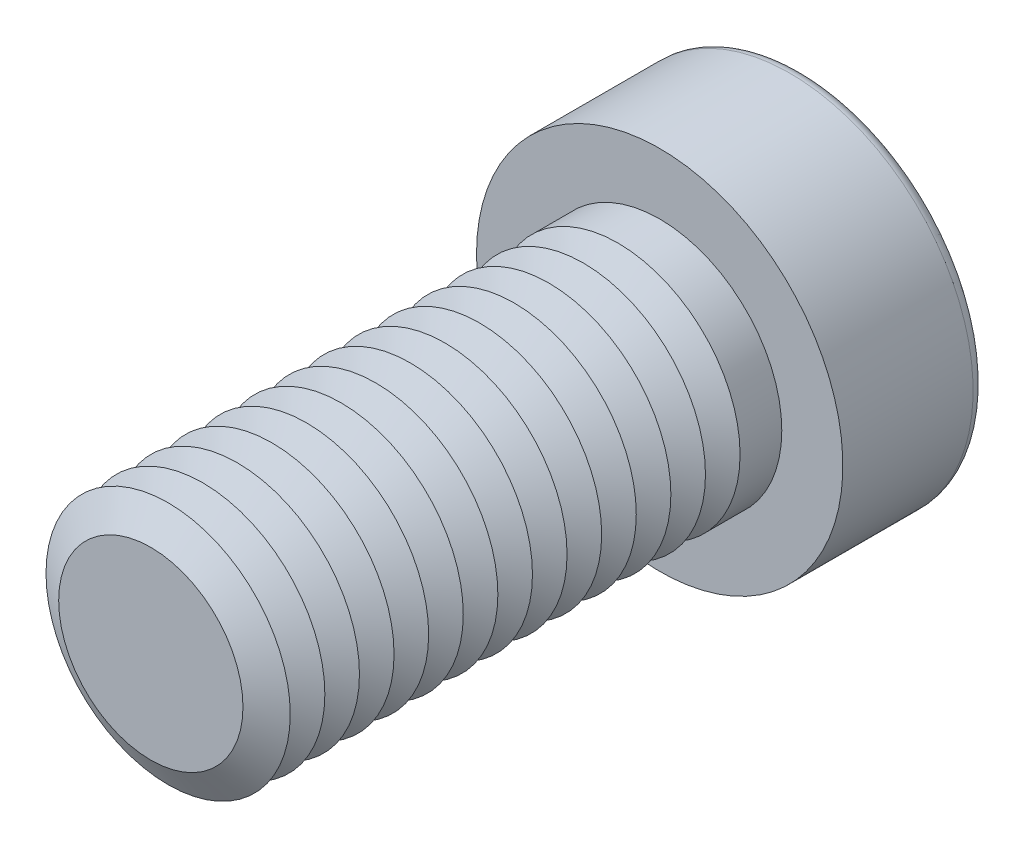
from build123d import *

# Parameters (mm, degrees)
SKETCH1_R           = 6
BOSS_EXTRUDE1_DEPTH = 25
SKETCH2_R           = 9
BOSS_EXTRUDE2_DEPTH = 7
CUT_EXTRUDE1_DEPTH  = 6
FILLET1_R           = 0.6
LPATTERN1_COUNT     = 14
LPATTERN1_PITCH     = 1.7


with BuildPart() as part:
    # Sketch1 → Boss-Extrude1 (new body)
    with BuildSketch(Plane.XY):
        Circle(SKETCH1_R)
    extrude(amount=BOSS_EXTRUDE1_DEPTH)

    # Sketch2 → Boss-Extrude2 (add)
    with BuildSketch(Plane(origin=(0, 0, 0), x_dir=(-1, 0, 0), z_dir=(0, 0, -1))):
        Circle(SKETCH2_R)
    extrude(amount=BOSS_EXTRUDE2_DEPTH)

    # Sketch3 → Cut-Extrude1 (cut)
    with BuildSketch(Plane(origin=(0, 0, -7), x_dir=(-1, 0, 0), z_dir=(0, 0, -1))):
        Polygon((-2.309401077, 4), (-4.618802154, 0), (-2.309401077, -4), (2.309401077, -4), (4.618802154, 0), (2.309401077, 4), align=None)
    extrude(amount=-CUT_EXTRUDE1_DEPTH, mode=Mode.SUBTRACT)

    # Fillet1
    fillet1_edges = [part.edges().sort_by_distance(p)[0] for p in [
        (9, 0, -7),
    ]]
    fillet(fillet1_edges, radius=FILLET1_R)

    # Cut-Extrude2 cone 1 section (on through the dimple's axis) → Cut-Extrude2 (revolve, cut)
    with BuildSketch(Plane(origin=(0, 0, -1), x_dir=(0, 1, 0), z_dir=(1, 0, 0))):
        Polygon((0, 0), (4, 0), (0, 2.309401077), align=None)
    revolve(axis=Axis((0, 0, -1), (0, 0, 1)), mode=Mode.SUBTRACT)

    # Cut-Extrude3 cone 1 section (on through the dimple's axis) → Cut-Extrude3 (revolve, cut)
    with BuildSketch(Plane(origin=(0, 0, -7), x_dir=(0, 1, 0), z_dir=(1, 0, 0))):
        Polygon((0, 0), (4.618802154, 0), (0, 1.237604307), align=None)
    revolve(axis=Axis((0, 0, -7), (0, 0, 1)), mode=Mode.SUBTRACT)

    # Sketch7 → Cut-Revolve1 (revolve, cut)
    with BuildSketch(Plane(origin=(0, 0, 0), x_dir=(0, 0, -1), z_dir=(1, 0, 0)), mode=Mode.PRIVATE) as cut_revolve1_sk:
        Polygon((-25, 4.527756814), (-24.15, 6), (-25.85, 6), align=None)
    cut_revolve1 = revolve(cut_revolve1_sk.sketch.rotate(Axis((0, 0, 25), (0, 0, -1)), 90), axis=Axis((0, 0, 25), (0, 0, -1)), mode=Mode.SUBTRACT)

    # LPattern1: Cut-Revolve1 ×14
    with Locations(*[(0, 0, -i * LPATTERN1_PITCH) for i in range(1, LPATTERN1_COUNT)]):
        add(cut_revolve1, mode=Mode.SUBTRACT)


solid = part.part
